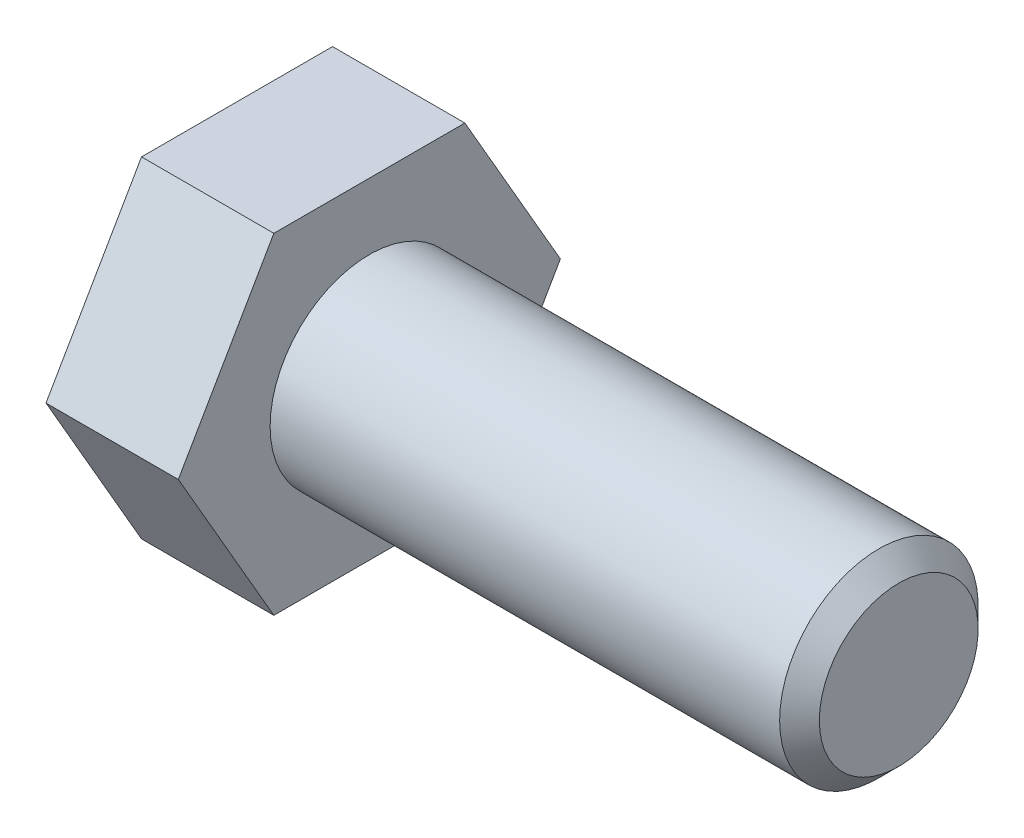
ISO-10303-21;
HEADER;
FILE_DESCRIPTION(('STEP AP214'),'2;1');
FILE_NAME('part.step','',(''),(''),'','','');
FILE_SCHEMA(('AUTOMOTIVE_DESIGN { 1 0 10303 214 1 1 1 1 }'));
ENDSEC;
DATA;
#1=APPLICATION_CONTEXT('core data for automotive mechanical design processes');
#2=APPLICATION_PROTOCOL_DEFINITION('international standard','automotive_design',2000,#1);
#3=PRODUCT_CONTEXT('',#1,'mechanical');
#4=PRODUCT('Part','Part','',(#3));
#5=PRODUCT_RELATED_PRODUCT_CATEGORY('part','',(#4));
#6=PRODUCT_DEFINITION_FORMATION('','',#4);
#7=PRODUCT_DEFINITION_CONTEXT('part definition',#1,'design');
#8=PRODUCT_DEFINITION('design','',#6,#7);
#9=PRODUCT_DEFINITION_SHAPE('','',#8);
#10=(LENGTH_UNIT() NAMED_UNIT(*) SI_UNIT(.MILLI.,.METRE.));
#11=(NAMED_UNIT(*) PLANE_ANGLE_UNIT() SI_UNIT($,.RADIAN.));
#12=(NAMED_UNIT(*) SI_UNIT($,.STERADIAN.) SOLID_ANGLE_UNIT());
#13=UNCERTAINTY_MEASURE_WITH_UNIT(LENGTH_MEASURE(1.E-05),#10,'distance_accuracy_value','');
#14=(GEOMETRIC_REPRESENTATION_CONTEXT(3) GLOBAL_UNCERTAINTY_ASSIGNED_CONTEXT((#13)) GLOBAL_UNIT_ASSIGNED_CONTEXT((#10,
#11,#12)) REPRESENTATION_CONTEXT('',''));
#15=CARTESIAN_POINT('',(0.,0.,0.));
#16=DIRECTION('',(0.,0.,1.));
#17=DIRECTION('',(1.,0.,0.));
#18=AXIS2_PLACEMENT_3D('',#15,#16,#17);
#19=CARTESIAN_POINT('',(2.,1.5,0.));
#20=DIRECTION('',(-1.,0.,0.));
#21=DIRECTION('',(0.,0.,1.));
#22=AXIS2_PLACEMENT_3D('',#19,#20,#21);
#23=PLANE('',#22);
#24=CARTESIAN_POINT('',(2.,0.,0.));
#25=DIRECTION('',(-1.,0.,0.));
#26=DIRECTION('',(0.,0.,1.));
#27=AXIS2_PLACEMENT_3D('',#24,#25,#26);
#28=CIRCLE('',#27,1.5);
#29=CARTESIAN_POINT('',(2.,0.,1.5));
#30=VERTEX_POINT('',#29);
#31=EDGE_CURVE('E137',#30,#30,#28,.T.);
#32=ORIENTED_EDGE('',*,*,#31,.T.);
#33=EDGE_LOOP('',(#32));
#34=FACE_BOUND('',#33,.T.);
#35=DIRECTION('',(0.,0.866025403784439,-0.5));
#36=VECTOR('',#35,1.);
#37=CARTESIAN_POINT('',(2.,2.375,1.51554445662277));
#38=LINE('',#37,#36);
#39=CARTESIAN_POINT('',(2.,0.,2.88675134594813));
#40=VERTEX_POINT('',#39);
#41=CARTESIAN_POINT('',(2.,2.5,1.44337567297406));
#42=VERTEX_POINT('',#41);
#43=EDGE_CURVE('E135',#40,#42,#38,.T.);
#44=ORIENTED_EDGE('',*,*,#43,.F.);
#45=DIRECTION('',(0.,0.866025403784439,0.5));
#46=VECTOR('',#45,1.);
#47=CARTESIAN_POINT('',(2.,-0.125000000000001,2.81458256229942));
#48=LINE('',#47,#46);
#49=CARTESIAN_POINT('',(2.,-2.5,1.44337567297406));
#50=VERTEX_POINT('',#49);
#51=EDGE_CURVE('E133',#50,#40,#48,.T.);
#52=ORIENTED_EDGE('',*,*,#51,.F.);
#53=DIRECTION('',(0.,0.,1.));
#54=VECTOR('',#53,1.);
#55=CARTESIAN_POINT('',(2.,-2.5,0.));
#56=LINE('',#55,#54);
#57=CARTESIAN_POINT('',(2.,-2.5,-1.44337567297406));
#58=VERTEX_POINT('',#57);
#59=EDGE_CURVE('E131',#58,#50,#56,.T.);
#60=ORIENTED_EDGE('',*,*,#59,.F.);
#61=DIRECTION('',(0.,-0.866025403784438,0.5));
#62=VECTOR('',#61,1.);
#63=CARTESIAN_POINT('',(2.,-0.125000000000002,-2.81458256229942));
#64=LINE('',#63,#62);
#65=CARTESIAN_POINT('',(2.,0.,-2.88675134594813));
#66=VERTEX_POINT('',#65);
#67=EDGE_CURVE('E129',#66,#58,#64,.T.);
#68=ORIENTED_EDGE('',*,*,#67,.F.);
#69=DIRECTION('',(0.,-0.866025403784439,-0.5));
#70=VECTOR('',#69,1.);
#71=CARTESIAN_POINT('',(2.,2.375,-1.51554445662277));
#72=LINE('',#71,#70);
#73=CARTESIAN_POINT('',(2.,2.5,-1.44337567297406));
#74=VERTEX_POINT('',#73);
#75=EDGE_CURVE('E91',#74,#66,#72,.T.);
#76=ORIENTED_EDGE('',*,*,#75,.F.);
#77=DIRECTION('',(0.,0.,-1.));
#78=VECTOR('',#77,1.);
#79=CARTESIAN_POINT('',(2.,2.5,0.));
#80=LINE('',#79,#78);
#81=EDGE_CURVE('E121',#42,#74,#80,.T.);
#82=ORIENTED_EDGE('',*,*,#81,.F.);
#83=EDGE_LOOP('',(#44,#52,#60,#68,#76,#82));
#84=FACE_BOUND('',#83,.T.);
#85=ADVANCED_FACE('F35',(#34,#84),#23,.F.);
#86=CARTESIAN_POINT('',(10.,0.,0.));
#87=DIRECTION('',(-1.,0.,0.));
#88=DIRECTION('',(0.,0.,1.));
#89=AXIS2_PLACEMENT_3D('',#86,#87,#88);
#90=PLANE('',#89);
#91=CARTESIAN_POINT('',(10.,0.,0.));
#92=DIRECTION('',(-1.,0.,0.));
#93=DIRECTION('',(0.,0.,1.));
#94=AXIS2_PLACEMENT_3D('',#91,#92,#93);
#95=CIRCLE('',#94,1.2);
#96=CARTESIAN_POINT('',(10.,0.,1.2));
#97=VERTEX_POINT('',#96);
#98=EDGE_CURVE('E12',#97,#97,#95,.F.);
#99=ORIENTED_EDGE('',*,*,#98,.T.);
#100=EDGE_LOOP('',(#99));
#101=FACE_BOUND('',#100,.T.);
#102=ADVANCED_FACE('F154',(#101),#90,.F.);
#103=CARTESIAN_POINT('',(0.,0.,0.));
#104=DIRECTION('',(-1.,0.,0.));
#105=DIRECTION('',(0.,0.,1.));
#106=AXIS2_PLACEMENT_3D('',#103,#104,#105);
#107=CYLINDRICAL_SURFACE('',#106,1.5);
#108=CARTESIAN_POINT('',(9.7,0.,0.));
#109=DIRECTION('',(-1.,0.,0.));
#110=DIRECTION('',(0.,0.,1.));
#111=AXIS2_PLACEMENT_3D('',#108,#109,#110);
#112=CIRCLE('',#111,1.5);
#113=CARTESIAN_POINT('',(9.7,0.,1.5));
#114=VERTEX_POINT('',#113);
#115=EDGE_CURVE('E43',#114,#114,#112,.T.);
#116=ORIENTED_EDGE('',*,*,#115,.T.);
#117=EDGE_LOOP('',(#116));
#118=FACE_BOUND('',#117,.T.);
#119=ORIENTED_EDGE('',*,*,#31,.F.);
#120=EDGE_LOOP('',(#119));
#121=FACE_BOUND('',#120,.T.);
#122=ADVANCED_FACE('F142',(#118,#121),#107,.T.);
#123=CARTESIAN_POINT('',(10.,0.,2.88675134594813));
#124=DIRECTION('',(0.,0.5,0.866025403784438));
#125=DIRECTION('',(0.,-0.866025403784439,0.5));
#126=AXIS2_PLACEMENT_3D('',#123,#124,#125);
#127=PLANE('',#126);
#128=ORIENTED_EDGE('',*,*,#43,.T.);
#129=DIRECTION('',(-1.,0.,0.));
#130=VECTOR('',#129,1.);
#131=CARTESIAN_POINT('',(10.,2.5,1.44337567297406));
#132=LINE('',#131,#130);
#133=CARTESIAN_POINT('',(0.,2.5,1.44337567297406));
#134=VERTEX_POINT('',#133);
#135=EDGE_CURVE('E50',#42,#134,#132,.T.);
#136=ORIENTED_EDGE('',*,*,#135,.T.);
#137=DIRECTION('',(0.,0.866025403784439,-0.5));
#138=VECTOR('',#137,1.);
#139=CARTESIAN_POINT('',(0.,0.,2.88675134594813));
#140=LINE('',#139,#138);
#141=CARTESIAN_POINT('',(0.,0.,2.88675134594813));
#142=VERTEX_POINT('',#141);
#143=EDGE_CURVE('E111',#142,#134,#140,.T.);
#144=ORIENTED_EDGE('',*,*,#143,.F.);
#145=DIRECTION('',(-1.,0.,0.));
#146=VECTOR('',#145,1.);
#147=CARTESIAN_POINT('',(10.,0.,2.88675134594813));
#148=LINE('',#147,#146);
#149=EDGE_CURVE('E119',#40,#142,#148,.T.);
#150=ORIENTED_EDGE('',*,*,#149,.F.);
#151=EDGE_LOOP('',(#128,#136,#144,#150));
#152=FACE_BOUND('',#151,.T.);
#153=ADVANCED_FACE('F165',(#152),#127,.T.);
#154=CARTESIAN_POINT('',(10.,-2.5,1.44337567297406));
#155=DIRECTION('',(0.,-0.5,0.866025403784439));
#156=DIRECTION('',(0.,-0.866025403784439,-0.5));
#157=AXIS2_PLACEMENT_3D('',#154,#155,#156);
#158=PLANE('',#157);
#159=ORIENTED_EDGE('',*,*,#51,.T.);
#160=ORIENTED_EDGE('',*,*,#149,.T.);
#161=DIRECTION('',(0.,0.866025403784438,0.5));
#162=VECTOR('',#161,1.);
#163=CARTESIAN_POINT('',(0.,-2.5,1.44337567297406));
#164=LINE('',#163,#162);
#165=CARTESIAN_POINT('',(0.,-2.5,1.44337567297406));
#166=VERTEX_POINT('',#165);
#167=EDGE_CURVE('E116',#166,#142,#164,.T.);
#168=ORIENTED_EDGE('',*,*,#167,.F.);
#169=DIRECTION('',(-1.,0.,0.));
#170=VECTOR('',#169,1.);
#171=CARTESIAN_POINT('',(10.,-2.5,1.44337567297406));
#172=LINE('',#171,#170);
#173=EDGE_CURVE('E122',#50,#166,#172,.T.);
#174=ORIENTED_EDGE('',*,*,#173,.F.);
#175=EDGE_LOOP('',(#159,#160,#168,#174));
#176=FACE_BOUND('',#175,.T.);
#177=ADVANCED_FACE('F169',(#176),#158,.T.);
#178=CARTESIAN_POINT('',(10.,-2.5,-1.44337567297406));
#179=DIRECTION('',(0.,-1.,0.));
#180=DIRECTION('',(0.,0.,-1.));
#181=AXIS2_PLACEMENT_3D('',#178,#179,#180);
#182=PLANE('',#181);
#183=ORIENTED_EDGE('',*,*,#59,.T.);
#184=ORIENTED_EDGE('',*,*,#173,.T.);
#185=DIRECTION('',(0.,0.,1.));
#186=VECTOR('',#185,1.);
#187=CARTESIAN_POINT('',(0.,-2.5,-1.44337567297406));
#188=LINE('',#187,#186);
#189=CARTESIAN_POINT('',(0.,-2.5,-1.44337567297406));
#190=VERTEX_POINT('',#189);
#191=EDGE_CURVE('E104',#190,#166,#188,.T.);
#192=ORIENTED_EDGE('',*,*,#191,.F.);
#193=DIRECTION('',(-1.,0.,0.));
#194=VECTOR('',#193,1.);
#195=CARTESIAN_POINT('',(10.,-2.5,-1.44337567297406));
#196=LINE('',#195,#194);
#197=EDGE_CURVE('E94',#58,#190,#196,.T.);
#198=ORIENTED_EDGE('',*,*,#197,.F.);
#199=EDGE_LOOP('',(#183,#184,#192,#198));
#200=FACE_BOUND('',#199,.T.);
#201=ADVANCED_FACE('F174',(#200),#182,.T.);
#202=CARTESIAN_POINT('',(10.,0.,-2.88675134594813));
#203=DIRECTION('',(0.,-0.5,-0.866025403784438));
#204=DIRECTION('',(0.,0.866025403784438,-0.5));
#205=AXIS2_PLACEMENT_3D('',#202,#203,#204);
#206=PLANE('',#205);
#207=ORIENTED_EDGE('',*,*,#67,.T.);
#208=ORIENTED_EDGE('',*,*,#197,.T.);
#209=DIRECTION('',(0.,-0.866025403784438,0.5));
#210=VECTOR('',#209,1.);
#211=CARTESIAN_POINT('',(0.,0.,-2.88675134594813));
#212=LINE('',#211,#210);
#213=CARTESIAN_POINT('',(0.,0.,-2.88675134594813));
#214=VERTEX_POINT('',#213);
#215=EDGE_CURVE('E98',#214,#190,#212,.T.);
#216=ORIENTED_EDGE('',*,*,#215,.F.);
#217=DIRECTION('',(-1.,0.,0.));
#218=VECTOR('',#217,1.);
#219=CARTESIAN_POINT('',(10.,0.,-2.88675134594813));
#220=LINE('',#219,#218);
#221=EDGE_CURVE('E87',#66,#214,#220,.T.);
#222=ORIENTED_EDGE('',*,*,#221,.F.);
#223=EDGE_LOOP('',(#207,#208,#216,#222));
#224=FACE_BOUND('',#223,.T.);
#225=ADVANCED_FACE('F99',(#224),#206,.T.);
#226=CARTESIAN_POINT('',(10.,2.5,-1.44337567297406));
#227=DIRECTION('',(0.,0.5,-0.866025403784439));
#228=DIRECTION('',(0.,0.866025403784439,0.5));
#229=AXIS2_PLACEMENT_3D('',#226,#227,#228);
#230=PLANE('',#229);
#231=ORIENTED_EDGE('',*,*,#75,.T.);
#232=ORIENTED_EDGE('',*,*,#221,.T.);
#233=DIRECTION('',(0.,-0.866025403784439,-0.5));
#234=VECTOR('',#233,1.);
#235=CARTESIAN_POINT('',(0.,2.5,-1.44337567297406));
#236=LINE('',#235,#234);
#237=CARTESIAN_POINT('',(0.,2.5,-1.44337567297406));
#238=VERTEX_POINT('',#237);
#239=EDGE_CURVE('E58',#238,#214,#236,.T.);
#240=ORIENTED_EDGE('',*,*,#239,.F.);
#241=DIRECTION('',(-1.,0.,0.));
#242=VECTOR('',#241,1.);
#243=CARTESIAN_POINT('',(10.,2.5,-1.44337567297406));
#244=LINE('',#243,#242);
#245=EDGE_CURVE('E95',#74,#238,#244,.T.);
#246=ORIENTED_EDGE('',*,*,#245,.F.);
#247=EDGE_LOOP('',(#231,#232,#240,#246));
#248=FACE_BOUND('',#247,.T.);
#249=ADVANCED_FACE('F89',(#248),#230,.T.);
#250=CARTESIAN_POINT('',(10.,2.5,1.44337567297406));
#251=DIRECTION('',(0.,1.,0.));
#252=DIRECTION('',(0.,0.,1.));
#253=AXIS2_PLACEMENT_3D('',#250,#251,#252);
#254=PLANE('',#253);
#255=ORIENTED_EDGE('',*,*,#81,.T.);
#256=ORIENTED_EDGE('',*,*,#245,.T.);
#257=DIRECTION('',(0.,0.,-1.));
#258=VECTOR('',#257,1.);
#259=CARTESIAN_POINT('',(0.,2.5,1.44337567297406));
#260=LINE('',#259,#258);
#261=EDGE_CURVE('E109',#134,#238,#260,.T.);
#262=ORIENTED_EDGE('',*,*,#261,.F.);
#263=ORIENTED_EDGE('',*,*,#135,.F.);
#264=EDGE_LOOP('',(#255,#256,#262,#263));
#265=FACE_BOUND('',#264,.T.);
#266=ADVANCED_FACE('F150',(#265),#254,.T.);
#267=CARTESIAN_POINT('',(0.,3.5,0.));
#268=DIRECTION('',(1.,0.,0.));
#269=DIRECTION('',(0.,0.,-1.));
#270=AXIS2_PLACEMENT_3D('',#267,#268,#269);
#271=PLANE('',#270);
#272=ORIENTED_EDGE('',*,*,#143,.T.);
#273=ORIENTED_EDGE('',*,*,#261,.T.);
#274=ORIENTED_EDGE('',*,*,#239,.T.);
#275=ORIENTED_EDGE('',*,*,#215,.T.);
#276=ORIENTED_EDGE('',*,*,#191,.T.);
#277=ORIENTED_EDGE('',*,*,#167,.T.);
#278=EDGE_LOOP('',(#272,#273,#274,#275,#276,#277));
#279=FACE_BOUND('',#278,.T.);
#280=ADVANCED_FACE('F108',(#279),#271,.F.);
#281=CARTESIAN_POINT('',(9.7,0.,0.));
#282=DIRECTION('',(-1.,0.,0.));
#283=DIRECTION('',(0.,0.,1.));
#284=AXIS2_PLACEMENT_3D('',#281,#282,#283);
#285=CONICAL_SURFACE('',#284,1.5,0.78539816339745);
#286=ORIENTED_EDGE('',*,*,#98,.F.);
#287=EDGE_LOOP('',(#286));
#288=FACE_BOUND('',#287,.T.);
#289=ORIENTED_EDGE('',*,*,#115,.F.);
#290=EDGE_LOOP('',(#289));
#291=FACE_BOUND('',#290,.T.);
#292=ADVANCED_FACE('F37',(#288,#291),#285,.T.);
#293=CLOSED_SHELL('',(#85,#102,#122,#153,#177,#201,#225,#249,#266,#280,#292));
#294=MANIFOLD_SOLID_BREP('B2',#293);
#295=ADVANCED_BREP_SHAPE_REPRESENTATION('',(#18,#294),#14);
#296=SHAPE_DEFINITION_REPRESENTATION(#9,#295);
ENDSEC;
END-ISO-10303-21;
